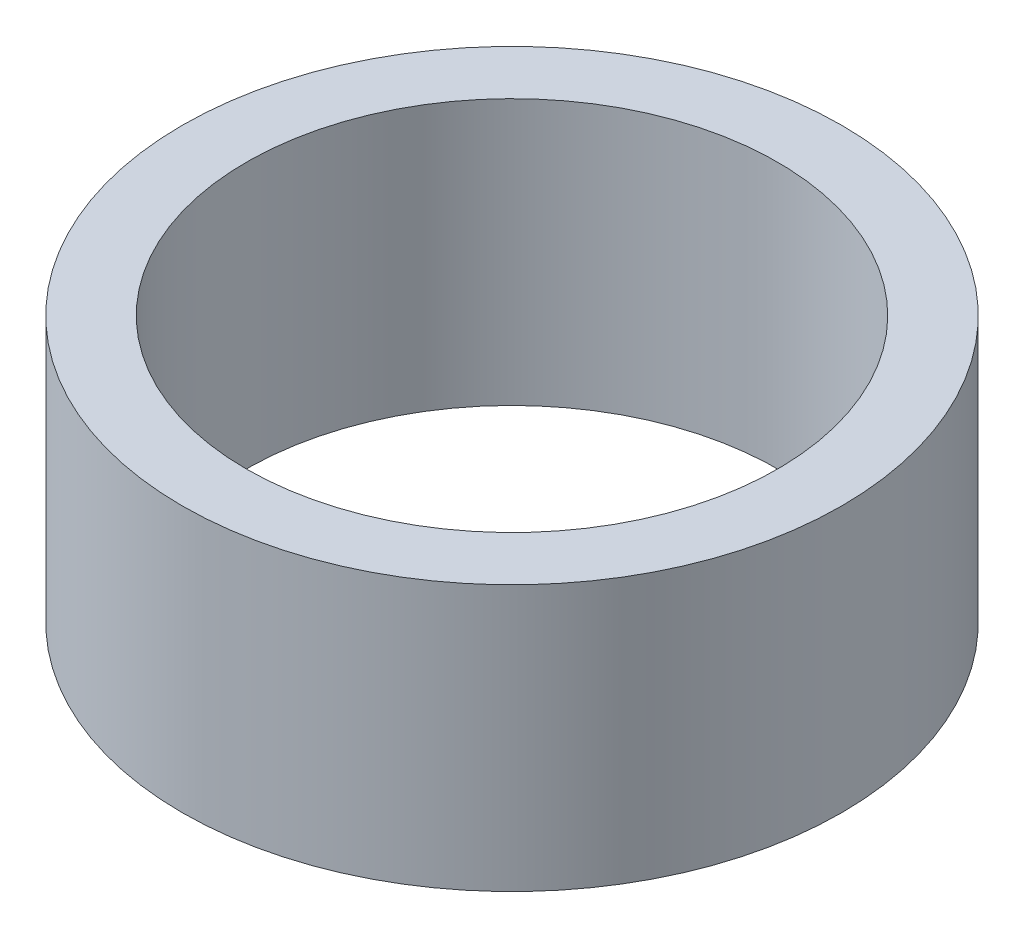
ISO-10303-21;
HEADER;
FILE_DESCRIPTION(('STEP AP214'),'2;1');
FILE_NAME('part.step','',(''),(''),'','','');
FILE_SCHEMA(('AUTOMOTIVE_DESIGN { 1 0 10303 214 1 1 1 1 }'));
ENDSEC;
DATA;
#1=APPLICATION_CONTEXT('core data for automotive mechanical design processes');
#2=APPLICATION_PROTOCOL_DEFINITION('international standard','automotive_design',2000,#1);
#3=PRODUCT_CONTEXT('',#1,'mechanical');
#4=PRODUCT('Part','Part','',(#3));
#5=PRODUCT_RELATED_PRODUCT_CATEGORY('part','',(#4));
#6=PRODUCT_DEFINITION_FORMATION('','',#4);
#7=PRODUCT_DEFINITION_CONTEXT('part definition',#1,'design');
#8=PRODUCT_DEFINITION('design','',#6,#7);
#9=PRODUCT_DEFINITION_SHAPE('','',#8);
#10=(LENGTH_UNIT() NAMED_UNIT(*) SI_UNIT(.MILLI.,.METRE.));
#11=(NAMED_UNIT(*) PLANE_ANGLE_UNIT() SI_UNIT($,.RADIAN.));
#12=(NAMED_UNIT(*) SI_UNIT($,.STERADIAN.) SOLID_ANGLE_UNIT());
#13=UNCERTAINTY_MEASURE_WITH_UNIT(LENGTH_MEASURE(1.E-05),#10,'distance_accuracy_value','');
#14=(GEOMETRIC_REPRESENTATION_CONTEXT(3) GLOBAL_UNCERTAINTY_ASSIGNED_CONTEXT((#13)) GLOBAL_UNIT_ASSIGNED_CONTEXT((#10,
#11,#12)) REPRESENTATION_CONTEXT('',''));
#15=CARTESIAN_POINT('',(0.,0.,0.));
#16=DIRECTION('',(0.,0.,1.));
#17=DIRECTION('',(1.,0.,0.));
#18=AXIS2_PLACEMENT_3D('',#15,#16,#17);
#19=CARTESIAN_POINT('',(0.,0.,0.));
#20=DIRECTION('',(0.,1.,0.));
#21=DIRECTION('',(0.,0.,1.));
#22=AXIS2_PLACEMENT_3D('',#19,#20,#21);
#23=CYLINDRICAL_SURFACE('',#22,9.26253333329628);
#24=CARTESIAN_POINT('',(0.,9.26253333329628,0.));
#25=DIRECTION('',(0.,1.,0.));
#26=DIRECTION('',(0.,0.,1.));
#27=AXIS2_PLACEMENT_3D('',#24,#25,#26);
#28=CIRCLE('',#27,9.26253333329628);
#29=CARTESIAN_POINT('',(0.,9.26253333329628,9.26253333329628));
#30=VERTEX_POINT('',#29);
#31=EDGE_CURVE('E16',#30,#30,#28,.F.);
#32=ORIENTED_EDGE('',*,*,#31,.F.);
#33=EDGE_LOOP('',(#32));
#34=FACE_BOUND('',#33,.T.);
#35=CARTESIAN_POINT('',(0.,0.,0.));
#36=DIRECTION('',(0.,1.,0.));
#37=DIRECTION('',(0.,0.,1.));
#38=AXIS2_PLACEMENT_3D('',#35,#36,#37);
#39=CIRCLE('',#38,9.26253333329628);
#40=CARTESIAN_POINT('',(0.,0.,9.26253333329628));
#41=VERTEX_POINT('',#40);
#42=EDGE_CURVE('E25',#41,#41,#39,.F.);
#43=ORIENTED_EDGE('',*,*,#42,.T.);
#44=EDGE_LOOP('',(#43));
#45=FACE_BOUND('',#44,.T.);
#46=ADVANCED_FACE('F13',(#34,#45),#23,.F.);
#47=CARTESIAN_POINT('',(0.,9.26253333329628,0.));
#48=DIRECTION('',(0.,1.,0.));
#49=DIRECTION('',(0.,0.,1.));
#50=AXIS2_PLACEMENT_3D('',#47,#48,#49);
#51=PLANE('',#50);
#52=ORIENTED_EDGE('',*,*,#31,.T.);
#53=EDGE_LOOP('',(#52));
#54=FACE_BOUND('',#53,.T.);
#55=CARTESIAN_POINT('',(0.,9.26253333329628,0.));
#56=DIRECTION('',(0.,1.,0.));
#57=DIRECTION('',(0.,0.,1.));
#58=AXIS2_PLACEMENT_3D('',#55,#56,#57);
#59=CIRCLE('',#58,11.4935);
#60=CARTESIAN_POINT('',(0.,9.26253333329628,11.4935));
#61=VERTEX_POINT('',#60);
#62=EDGE_CURVE('E20',#61,#61,#59,.F.);
#63=ORIENTED_EDGE('',*,*,#62,.F.);
#64=EDGE_LOOP('',(#63));
#65=FACE_BOUND('',#64,.T.);
#66=ADVANCED_FACE('F33',(#54,#65),#51,.T.);
#67=CARTESIAN_POINT('',(0.,0.,0.));
#68=DIRECTION('',(0.,1.,0.));
#69=DIRECTION('',(0.,0.,1.));
#70=AXIS2_PLACEMENT_3D('',#67,#68,#69);
#71=PLANE('',#70);
#72=ORIENTED_EDGE('',*,*,#42,.F.);
#73=EDGE_LOOP('',(#72));
#74=FACE_BOUND('',#73,.T.);
#75=CARTESIAN_POINT('',(0.,0.,0.));
#76=DIRECTION('',(0.,1.,0.));
#77=DIRECTION('',(0.,0.,1.));
#78=AXIS2_PLACEMENT_3D('',#75,#76,#77);
#79=CIRCLE('',#78,11.4935);
#80=CARTESIAN_POINT('',(0.,0.,11.4935));
#81=VERTEX_POINT('',#80);
#82=EDGE_CURVE('E9',#81,#81,#79,.T.);
#83=ORIENTED_EDGE('',*,*,#82,.F.);
#84=EDGE_LOOP('',(#83));
#85=FACE_BOUND('',#84,.T.);
#86=ADVANCED_FACE('F41',(#74,#85),#71,.F.);
#87=CARTESIAN_POINT('',(0.,0.,0.));
#88=DIRECTION('',(0.,1.,0.));
#89=DIRECTION('',(0.,0.,1.));
#90=AXIS2_PLACEMENT_3D('',#87,#88,#89);
#91=CYLINDRICAL_SURFACE('',#90,11.4935);
#92=ORIENTED_EDGE('',*,*,#62,.T.);
#93=EDGE_LOOP('',(#92));
#94=FACE_BOUND('',#93,.T.);
#95=ORIENTED_EDGE('',*,*,#82,.T.);
#96=EDGE_LOOP('',(#95));
#97=FACE_BOUND('',#96,.T.);
#98=ADVANCED_FACE('F42',(#94,#97),#91,.T.);
#99=CLOSED_SHELL('',(#46,#66,#86,#98));
#100=MANIFOLD_SOLID_BREP('B1',#99);
#101=ADVANCED_BREP_SHAPE_REPRESENTATION('',(#18,#100),#14);
#102=SHAPE_DEFINITION_REPRESENTATION(#9,#101);
ENDSEC;
END-ISO-10303-21;
